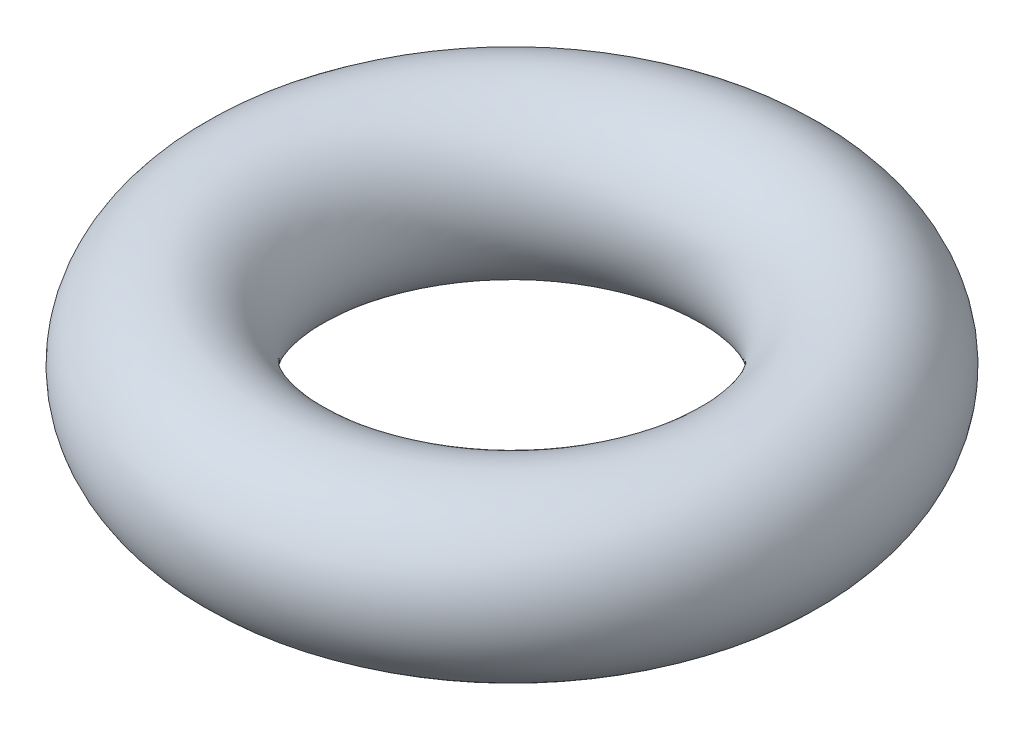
ISO-10303-21;
HEADER;
FILE_DESCRIPTION(('STEP AP214'),'2;1');
FILE_NAME('part.step','',(''),(''),'','','');
FILE_SCHEMA(('AUTOMOTIVE_DESIGN { 1 0 10303 214 1 1 1 1 }'));
ENDSEC;
DATA;
#1=APPLICATION_CONTEXT('core data for automotive mechanical design processes');
#2=APPLICATION_PROTOCOL_DEFINITION('international standard','automotive_design',2000,#1);
#3=PRODUCT_CONTEXT('',#1,'mechanical');
#4=PRODUCT('Part','Part','',(#3));
#5=PRODUCT_RELATED_PRODUCT_CATEGORY('part','',(#4));
#6=PRODUCT_DEFINITION_FORMATION('','',#4);
#7=PRODUCT_DEFINITION_CONTEXT('part definition',#1,'design');
#8=PRODUCT_DEFINITION('design','',#6,#7);
#9=PRODUCT_DEFINITION_SHAPE('','',#8);
#10=(LENGTH_UNIT() NAMED_UNIT(*) SI_UNIT(.MILLI.,.METRE.));
#11=(NAMED_UNIT(*) PLANE_ANGLE_UNIT() SI_UNIT($,.RADIAN.));
#12=(NAMED_UNIT(*) SI_UNIT($,.STERADIAN.) SOLID_ANGLE_UNIT());
#13=UNCERTAINTY_MEASURE_WITH_UNIT(LENGTH_MEASURE(1.E-05),#10,'distance_accuracy_value','');
#14=(GEOMETRIC_REPRESENTATION_CONTEXT(3) GLOBAL_UNCERTAINTY_ASSIGNED_CONTEXT((#13)) GLOBAL_UNIT_ASSIGNED_CONTEXT((#10,
#11,#12)) REPRESENTATION_CONTEXT('',''));
#15=CARTESIAN_POINT('',(0.,0.,0.));
#16=DIRECTION('',(0.,0.,1.));
#17=DIRECTION('',(1.,0.,0.));
#18=AXIS2_PLACEMENT_3D('',#15,#16,#17);
#19=CARTESIAN_POINT('',(0.,0.,0.));
#20=DIRECTION('',(0.,-1.,0.));
#21=DIRECTION('',(0.,0.,-1.));
#22=AXIS2_PLACEMENT_3D('',#19,#20,#21);
#23=TOROIDAL_SURFACE('',#22,4.5,1.5);
#24=CARTESIAN_POINT('',(0.,0.,-6.));
#25=VERTEX_POINT('',#24);
#26=VERTEX_LOOP('',#25);
#27=FACE_BOUND('',#26,.T.);
#28=ADVANCED_FACE('F20',(#27),#23,.T.);
#29=CLOSED_SHELL('',(#28));
#30=MANIFOLD_SOLID_BREP('B2',#29);
#31=ADVANCED_BREP_SHAPE_REPRESENTATION('',(#18,#30),#14);
#32=SHAPE_DEFINITION_REPRESENTATION(#9,#31);
ENDSEC;
END-ISO-10303-21;
